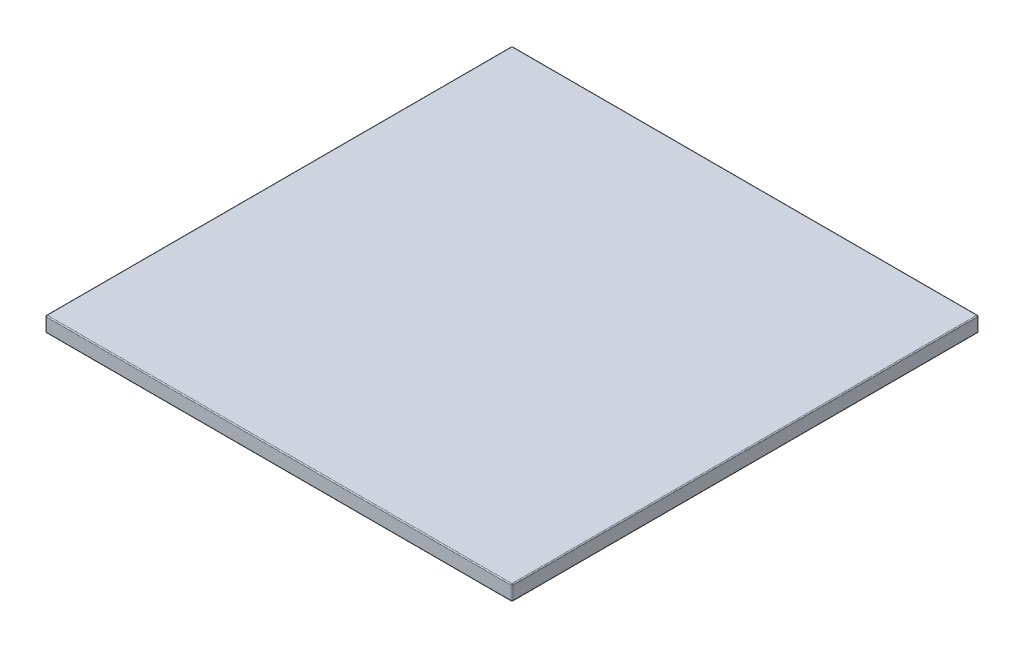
from build123d import *

# Parameters (mm, degrees)
SKETCH1_W      = 1219.2
SKETCH1_H      = 1219.2
EXTRUDE1_DEPTH = 39.5
FILLET1_R      = 2.54


with BuildPart() as part:
    # Sketch1 → Extrude1 (new body)
    with BuildSketch(Plane(origin=(0, 0, 0), x_dir=(1, 0, 0), z_dir=(0, 1, 0))):
        with Locations((609.6, 609.6)):
            Rectangle(SKETCH1_W, SKETCH1_H)
    extrude(amount=EXTRUDE1_DEPTH)

    # Fillet1
    fillet1_edges = [part.edges().sort_by_distance(p)[0] for p in [
        (1219.2, 39.5, -609.6),
        (609.6, 39.5, -1219.2),
        (0, 39.5, -609.6),
        (609.6, 0, -1219.2),
        (1219.2, 0, -609.6),
        (609.6, 0, 0),
        (0, 0, -609.6),
        (609.6, 39.5, 0),
        (0, 19.75, -1219.2),
        (1219.2, 19.75, -1219.2),
        (1219.2, 19.75, 0),
        (0, 19.75, 0),
    ]]
    fillet(fillet1_edges, radius=FILLET1_R)


solid = part.part
